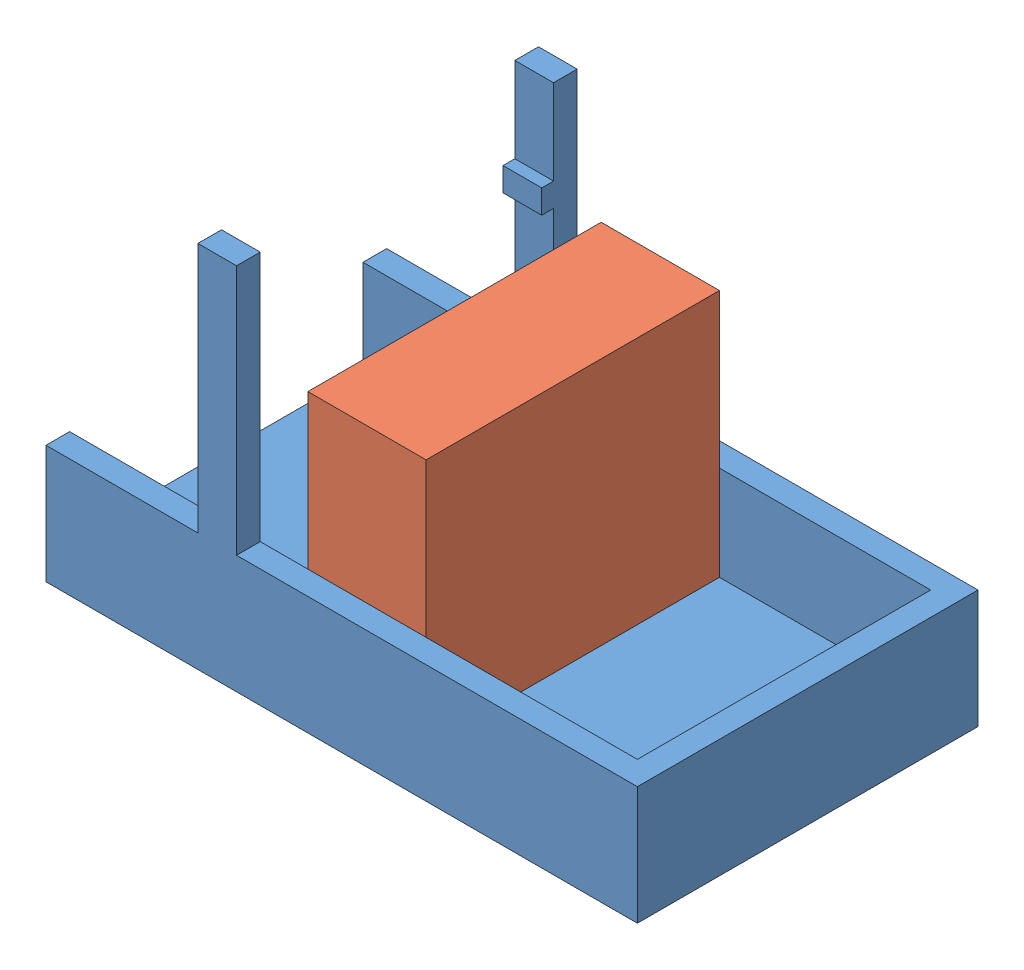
SolidWorks assembly Collision Detection.SLDASM, configuration Default (file format 7000). Lengths in mm.
Overall size (250 156 144).
2 component instances, 2 part files, 2 mates.
Components (placement in the parent):
- Slide-1: Slide.SLDPRT [Default] at origin size (250 156 144)
- block-1: block.SLDPRT [Default] at (125.6957 10 0) size (50 105 124)
Mates (geometry in assembly coordinates):
- Coincident1: coincident anti-aligned: plane of Slide-1 through (0 10 72) normal (0 1 0); plane of block-1 through (100.6957 10 62) normal (0 -1 0)
- Coincident2: coincident anti-aligned: plane of Slide-1 through (0 50 62) normal (0 0 -1); plane of block-1 through (100.6957 115 62) normal (0 0 1)
